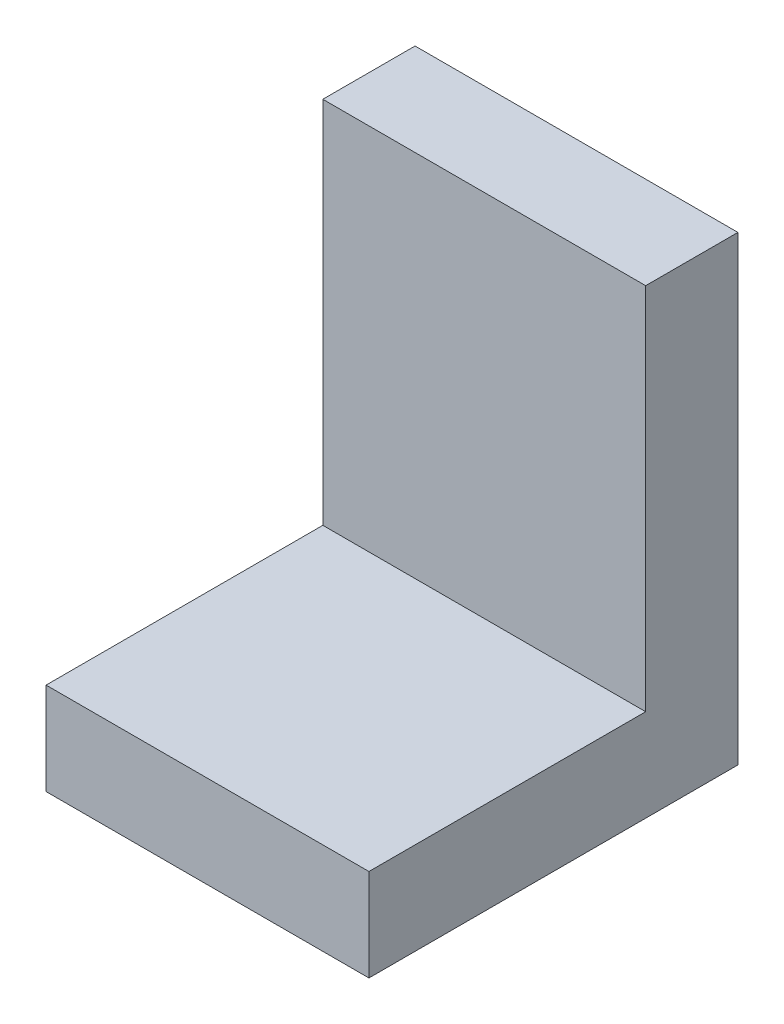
ISO-10303-21;
HEADER;
FILE_DESCRIPTION(('STEP AP214'),'2;1');
FILE_NAME('part.step','',(''),(''),'','','');
FILE_SCHEMA(('AUTOMOTIVE_DESIGN { 1 0 10303 214 1 1 1 1 }'));
ENDSEC;
DATA;
#1=APPLICATION_CONTEXT('core data for automotive mechanical design processes');
#2=APPLICATION_PROTOCOL_DEFINITION('international standard','automotive_design',2000,#1);
#3=PRODUCT_CONTEXT('',#1,'mechanical');
#4=PRODUCT('Part','Part','',(#3));
#5=PRODUCT_RELATED_PRODUCT_CATEGORY('part','',(#4));
#6=PRODUCT_DEFINITION_FORMATION('','',#4);
#7=PRODUCT_DEFINITION_CONTEXT('part definition',#1,'design');
#8=PRODUCT_DEFINITION('design','',#6,#7);
#9=PRODUCT_DEFINITION_SHAPE('','',#8);
#10=(LENGTH_UNIT() NAMED_UNIT(*) SI_UNIT(.MILLI.,.METRE.));
#11=(NAMED_UNIT(*) PLANE_ANGLE_UNIT() SI_UNIT($,.RADIAN.));
#12=(NAMED_UNIT(*) SI_UNIT($,.STERADIAN.) SOLID_ANGLE_UNIT());
#13=UNCERTAINTY_MEASURE_WITH_UNIT(LENGTH_MEASURE(1.E-05),#10,'distance_accuracy_value','');
#14=(GEOMETRIC_REPRESENTATION_CONTEXT(3) GLOBAL_UNCERTAINTY_ASSIGNED_CONTEXT((#13)) GLOBAL_UNIT_ASSIGNED_CONTEXT((#10,
#11,#12)) REPRESENTATION_CONTEXT('',''));
#15=CARTESIAN_POINT('',(0.,0.,0.));
#16=DIRECTION('',(0.,0.,1.));
#17=DIRECTION('',(1.,0.,0.));
#18=AXIS2_PLACEMENT_3D('',#15,#16,#17);
#19=CARTESIAN_POINT('',(44.45,0.,-25.4));
#20=DIRECTION('',(0.,0.,1.));
#21=DIRECTION('',(1.,0.,0.));
#22=AXIS2_PLACEMENT_3D('',#19,#20,#21);
#23=PLANE('',#22);
#24=DIRECTION('',(0.,1.,0.));
#25=VECTOR('',#24,1.);
#26=CARTESIAN_POINT('',(-44.45,0.,-25.4));
#27=LINE('',#26,#25);
#28=CARTESIAN_POINT('',(-44.45,-25.4,-25.4));
#29=VERTEX_POINT('',#28);
#30=CARTESIAN_POINT('',(-44.45,101.6,-25.4));
#31=VERTEX_POINT('',#30);
#32=EDGE_CURVE('E112',#29,#31,#27,.T.);
#33=ORIENTED_EDGE('',*,*,#32,.T.);
#34=DIRECTION('',(-1.,0.,0.));
#35=VECTOR('',#34,1.);
#36=CARTESIAN_POINT('',(44.45,101.6,-25.4));
#37=LINE('',#36,#35);
#38=CARTESIAN_POINT('',(44.45,101.6,-25.4));
#39=VERTEX_POINT('',#38);
#40=EDGE_CURVE('E11',#39,#31,#37,.T.);
#41=ORIENTED_EDGE('',*,*,#40,.F.);
#42=DIRECTION('',(0.,1.,0.));
#43=VECTOR('',#42,1.);
#44=CARTESIAN_POINT('',(44.45,0.,-25.4));
#45=LINE('',#44,#43);
#46=CARTESIAN_POINT('',(44.45,-25.4,-25.4));
#47=VERTEX_POINT('',#46);
#48=EDGE_CURVE('E77',#47,#39,#45,.T.);
#49=ORIENTED_EDGE('',*,*,#48,.F.);
#50=DIRECTION('',(-1.,0.,0.));
#51=VECTOR('',#50,1.);
#52=CARTESIAN_POINT('',(44.45,-25.4,-25.4));
#53=LINE('',#52,#51);
#54=EDGE_CURVE('E108',#47,#29,#53,.T.);
#55=ORIENTED_EDGE('',*,*,#54,.T.);
#56=EDGE_LOOP('',(#33,#41,#49,#55));
#57=FACE_BOUND('',#56,.T.);
#58=ADVANCED_FACE('F31',(#57),#23,.F.);
#59=CARTESIAN_POINT('',(44.45,101.6,0.));
#60=DIRECTION('',(0.,1.,0.));
#61=DIRECTION('',(0.,0.,1.));
#62=AXIS2_PLACEMENT_3D('',#59,#60,#61);
#63=PLANE('',#62);
#64=DIRECTION('',(0.,0.,-1.));
#65=VECTOR('',#64,1.);
#66=CARTESIAN_POINT('',(-44.45,101.6,0.));
#67=LINE('',#66,#65);
#68=CARTESIAN_POINT('',(-44.45,101.6,0.));
#69=VERTEX_POINT('',#68);
#70=EDGE_CURVE('E115',#69,#31,#67,.T.);
#71=ORIENTED_EDGE('',*,*,#70,.F.);
#72=DIRECTION('',(-1.,0.,0.));
#73=VECTOR('',#72,1.);
#74=CARTESIAN_POINT('',(44.45,101.6,0.));
#75=LINE('',#74,#73);
#76=CARTESIAN_POINT('',(44.45,101.6,0.));
#77=VERTEX_POINT('',#76);
#78=EDGE_CURVE('E39',#77,#69,#75,.T.);
#79=ORIENTED_EDGE('',*,*,#78,.F.);
#80=DIRECTION('',(0.,0.,-1.));
#81=VECTOR('',#80,1.);
#82=CARTESIAN_POINT('',(44.45,101.6,0.));
#83=LINE('',#82,#81);
#84=EDGE_CURVE('E201',#77,#39,#83,.T.);
#85=ORIENTED_EDGE('',*,*,#84,.T.);
#86=ORIENTED_EDGE('',*,*,#40,.T.);
#87=EDGE_LOOP('',(#71,#79,#85,#86));
#88=FACE_BOUND('',#87,.T.);
#89=ADVANCED_FACE('F133',(#88),#63,.T.);
#90=CARTESIAN_POINT('',(44.45,0.,0.));
#91=DIRECTION('',(0.,0.,1.));
#92=DIRECTION('',(1.,0.,0.));
#93=AXIS2_PLACEMENT_3D('',#90,#91,#92);
#94=PLANE('',#93);
#95=DIRECTION('',(0.,1.,0.));
#96=VECTOR('',#95,1.);
#97=CARTESIAN_POINT('',(-44.45,0.,0.));
#98=LINE('',#97,#96);
#99=CARTESIAN_POINT('',(-44.45,0.,0.));
#100=VERTEX_POINT('',#99);
#101=EDGE_CURVE('E118',#100,#69,#98,.T.);
#102=ORIENTED_EDGE('',*,*,#101,.F.);
#103=DIRECTION('',(-1.,0.,0.));
#104=VECTOR('',#103,1.);
#105=CARTESIAN_POINT('',(44.45,0.,0.));
#106=LINE('',#105,#104);
#107=CARTESIAN_POINT('',(44.45,0.,0.));
#108=VERTEX_POINT('',#107);
#109=EDGE_CURVE('E98',#108,#100,#106,.T.);
#110=ORIENTED_EDGE('',*,*,#109,.F.);
#111=DIRECTION('',(0.,1.,0.));
#112=VECTOR('',#111,1.);
#113=CARTESIAN_POINT('',(44.45,0.,0.));
#114=LINE('',#113,#112);
#115=EDGE_CURVE('E104',#108,#77,#114,.T.);
#116=ORIENTED_EDGE('',*,*,#115,.T.);
#117=ORIENTED_EDGE('',*,*,#78,.T.);
#118=EDGE_LOOP('',(#102,#110,#116,#117));
#119=FACE_BOUND('',#118,.T.);
#120=ADVANCED_FACE('F130',(#119),#94,.T.);
#121=CARTESIAN_POINT('',(44.45,0.,0.));
#122=DIRECTION('',(0.,1.,0.));
#123=DIRECTION('',(0.,0.,1.));
#124=AXIS2_PLACEMENT_3D('',#121,#122,#123);
#125=PLANE('',#124);
#126=DIRECTION('',(0.,0.,-1.));
#127=VECTOR('',#126,1.);
#128=CARTESIAN_POINT('',(-44.45,0.,0.));
#129=LINE('',#128,#127);
#130=CARTESIAN_POINT('',(-44.45,0.,76.2));
#131=VERTEX_POINT('',#130);
#132=EDGE_CURVE('E93',#131,#100,#129,.T.);
#133=ORIENTED_EDGE('',*,*,#132,.F.);
#134=DIRECTION('',(-1.,0.,0.));
#135=VECTOR('',#134,1.);
#136=CARTESIAN_POINT('',(44.45,0.,76.2));
#137=LINE('',#136,#135);
#138=CARTESIAN_POINT('',(44.45,0.,76.2));
#139=VERTEX_POINT('',#138);
#140=EDGE_CURVE('E88',#139,#131,#137,.T.);
#141=ORIENTED_EDGE('',*,*,#140,.F.);
#142=DIRECTION('',(0.,0.,-1.));
#143=VECTOR('',#142,1.);
#144=CARTESIAN_POINT('',(44.45,0.,0.));
#145=LINE('',#144,#143);
#146=EDGE_CURVE('E91',#139,#108,#145,.T.);
#147=ORIENTED_EDGE('',*,*,#146,.T.);
#148=ORIENTED_EDGE('',*,*,#109,.T.);
#149=EDGE_LOOP('',(#133,#141,#147,#148));
#150=FACE_BOUND('',#149,.T.);
#151=ADVANCED_FACE('F90',(#150),#125,.T.);
#152=CARTESIAN_POINT('',(44.45,-25.4,76.2));
#153=DIRECTION('',(0.,0.,1.));
#154=DIRECTION('',(1.,0.,0.));
#155=AXIS2_PLACEMENT_3D('',#152,#153,#154);
#156=PLANE('',#155);
#157=DIRECTION('',(0.,1.,0.));
#158=VECTOR('',#157,1.);
#159=CARTESIAN_POINT('',(-44.45,-25.4,76.2));
#160=LINE('',#159,#158);
#161=CARTESIAN_POINT('',(-44.45,-25.4,76.2));
#162=VERTEX_POINT('',#161);
#163=EDGE_CURVE('E122',#162,#131,#160,.T.);
#164=ORIENTED_EDGE('',*,*,#163,.F.);
#165=DIRECTION('',(-1.,0.,0.));
#166=VECTOR('',#165,1.);
#167=CARTESIAN_POINT('',(44.45,-25.4,76.2));
#168=LINE('',#167,#166);
#169=CARTESIAN_POINT('',(44.45,-25.4,76.2));
#170=VERTEX_POINT('',#169);
#171=EDGE_CURVE('E68',#170,#162,#168,.T.);
#172=ORIENTED_EDGE('',*,*,#171,.F.);
#173=DIRECTION('',(0.,1.,0.));
#174=VECTOR('',#173,1.);
#175=CARTESIAN_POINT('',(44.45,-25.4,76.2));
#176=LINE('',#175,#174);
#177=EDGE_CURVE('E102',#170,#139,#176,.T.);
#178=ORIENTED_EDGE('',*,*,#177,.T.);
#179=ORIENTED_EDGE('',*,*,#140,.T.);
#180=EDGE_LOOP('',(#164,#172,#178,#179));
#181=FACE_BOUND('',#180,.T.);
#182=ADVANCED_FACE('F106',(#181),#156,.T.);
#183=CARTESIAN_POINT('',(44.45,-25.4,0.));
#184=DIRECTION('',(0.,1.,0.));
#185=DIRECTION('',(0.,0.,1.));
#186=AXIS2_PLACEMENT_3D('',#183,#184,#185);
#187=PLANE('',#186);
#188=DIRECTION('',(0.,0.,-1.));
#189=VECTOR('',#188,1.);
#190=CARTESIAN_POINT('',(-44.45,-25.4,0.));
#191=LINE('',#190,#189);
#192=EDGE_CURVE('E71',#162,#29,#191,.T.);
#193=ORIENTED_EDGE('',*,*,#192,.T.);
#194=ORIENTED_EDGE('',*,*,#54,.F.);
#195=DIRECTION('',(0.,0.,-1.));
#196=VECTOR('',#195,1.);
#197=CARTESIAN_POINT('',(44.45,-25.4,0.));
#198=LINE('',#197,#196);
#199=EDGE_CURVE('E47',#170,#47,#198,.T.);
#200=ORIENTED_EDGE('',*,*,#199,.F.);
#201=ORIENTED_EDGE('',*,*,#171,.T.);
#202=EDGE_LOOP('',(#193,#194,#200,#201));
#203=FACE_BOUND('',#202,.T.);
#204=ADVANCED_FACE('F138',(#203),#187,.F.);
#205=CARTESIAN_POINT('',(44.45,0.,-25.4));
#206=DIRECTION('',(-1.,0.,0.));
#207=DIRECTION('',(0.,0.,1.));
#208=AXIS2_PLACEMENT_3D('',#205,#206,#207);
#209=PLANE('',#208);
#210=ORIENTED_EDGE('',*,*,#48,.T.);
#211=ORIENTED_EDGE('',*,*,#84,.F.);
#212=ORIENTED_EDGE('',*,*,#115,.F.);
#213=ORIENTED_EDGE('',*,*,#146,.F.);
#214=ORIENTED_EDGE('',*,*,#177,.F.);
#215=ORIENTED_EDGE('',*,*,#199,.T.);
#216=EDGE_LOOP('',(#210,#211,#212,#213,#214,#215));
#217=FACE_BOUND('',#216,.T.);
#218=ADVANCED_FACE('F101',(#217),#209,.F.);
#219=CARTESIAN_POINT('',(-44.45,0.,-25.4));
#220=DIRECTION('',(-1.,0.,0.));
#221=DIRECTION('',(0.,0.,1.));
#222=AXIS2_PLACEMENT_3D('',#219,#220,#221);
#223=PLANE('',#222);
#224=ORIENTED_EDGE('',*,*,#32,.F.);
#225=ORIENTED_EDGE('',*,*,#192,.F.);
#226=ORIENTED_EDGE('',*,*,#163,.T.);
#227=ORIENTED_EDGE('',*,*,#132,.T.);
#228=ORIENTED_EDGE('',*,*,#101,.T.);
#229=ORIENTED_EDGE('',*,*,#70,.T.);
#230=EDGE_LOOP('',(#224,#225,#226,#227,#228,#229));
#231=FACE_BOUND('',#230,.T.);
#232=ADVANCED_FACE('F136',(#231),#223,.T.);
#233=CLOSED_SHELL('',(#58,#89,#120,#151,#182,#204,#218,#232));
#234=MANIFOLD_SOLID_BREP('B2',#233);
#235=ADVANCED_BREP_SHAPE_REPRESENTATION('',(#18,#234),#14);
#236=SHAPE_DEFINITION_REPRESENTATION(#9,#235);
ENDSEC;
END-ISO-10303-21;
